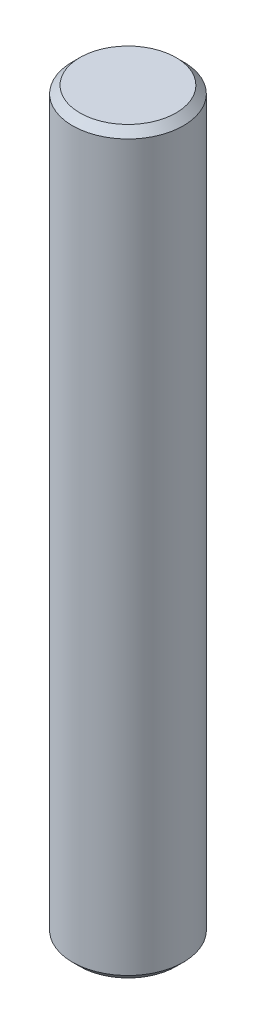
from build123d import *

# Parameters (mm, degrees)
ESQUISSE1_R      = 1.5
EXTRUSION1_DEPTH = 20
CHANFREIN1_SIZE  = 0.2


with BuildPart() as part:
    # Esquisse1 → Extrusion1 (new body)
    with BuildSketch(Plane(origin=(0, 0, 0), x_dir=(1, 0, 0), z_dir=(0, 1, 0))):
        with Locations(Location((0, 0, 0), (0, 0, 270))):
            Circle(ESQUISSE1_R)
    extrude(amount=EXTRUSION1_DEPTH)

    # Chanfrein1
    chanfrein1_edges = [part.edges().sort_by_distance(p)[0] for p in [
        (0, 0, -1.5),
        (0, 20, -1.5),
    ]]
    chamfer(chanfrein1_edges, length=CHANFREIN1_SIZE)


solid = part.part
